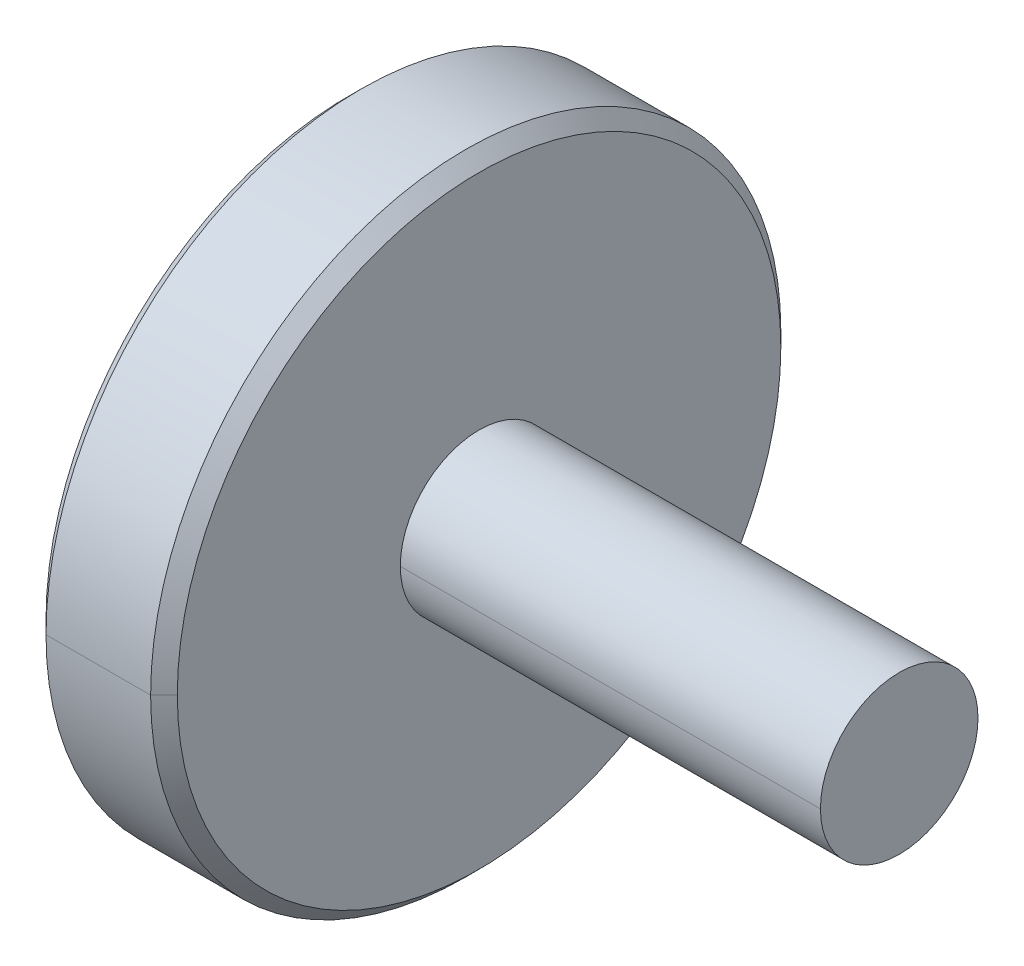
ISO-10303-21;
HEADER;
FILE_DESCRIPTION(('STEP AP214'),'2;1');
FILE_NAME('part.step','',(''),(''),'','','');
FILE_SCHEMA(('AUTOMOTIVE_DESIGN { 1 0 10303 214 1 1 1 1 }'));
ENDSEC;
DATA;
#1=APPLICATION_CONTEXT('core data for automotive mechanical design processes');
#2=APPLICATION_PROTOCOL_DEFINITION('international standard','automotive_design',2000,#1);
#3=PRODUCT_CONTEXT('',#1,'mechanical');
#4=PRODUCT('Part','Part','',(#3));
#5=PRODUCT_RELATED_PRODUCT_CATEGORY('part','',(#4));
#6=PRODUCT_DEFINITION_FORMATION('','',#4);
#7=PRODUCT_DEFINITION_CONTEXT('part definition',#1,'design');
#8=PRODUCT_DEFINITION('design','',#6,#7);
#9=PRODUCT_DEFINITION_SHAPE('','',#8);
#10=(LENGTH_UNIT() NAMED_UNIT(*) SI_UNIT(.MILLI.,.METRE.));
#11=(NAMED_UNIT(*) PLANE_ANGLE_UNIT() SI_UNIT($,.RADIAN.));
#12=(NAMED_UNIT(*) SI_UNIT($,.STERADIAN.) SOLID_ANGLE_UNIT());
#13=UNCERTAINTY_MEASURE_WITH_UNIT(LENGTH_MEASURE(1.E-05),#10,'distance_accuracy_value','');
#14=(GEOMETRIC_REPRESENTATION_CONTEXT(3) GLOBAL_UNCERTAINTY_ASSIGNED_CONTEXT((#13)) GLOBAL_UNIT_ASSIGNED_CONTEXT((#10,
#11,#12)) REPRESENTATION_CONTEXT('',''));
#15=CARTESIAN_POINT('',(0.,0.,0.));
#16=DIRECTION('',(0.,0.,1.));
#17=DIRECTION('',(1.,0.,0.));
#18=AXIS2_PLACEMENT_3D('',#15,#16,#17);
#19=CARTESIAN_POINT('',(0.,0.,0.));
#20=DIRECTION('',(-1.,0.,0.));
#21=DIRECTION('',(0.,0.,1.));
#22=AXIS2_PLACEMENT_3D('',#19,#20,#21);
#23=CYLINDRICAL_SURFACE('',#22,1.5);
#24=CARTESIAN_POINT('',(10.5,0.,0.));
#25=DIRECTION('',(1.,0.,0.));
#26=DIRECTION('',(0.,0.,1.));
#27=AXIS2_PLACEMENT_3D('',#24,#25,#26);
#28=CIRCLE('',#27,1.5);
#29=CARTESIAN_POINT('',(10.5,0.,1.5));
#30=VERTEX_POINT('',#29);
#31=CARTESIAN_POINT('',(10.5,0.,-1.5));
#32=VERTEX_POINT('',#31);
#33=EDGE_CURVE('E11',#30,#32,#28,.T.);
#34=ORIENTED_EDGE('',*,*,#33,.F.);
#35=DIRECTION('',(1.,0.,0.));
#36=VECTOR('',#35,1.);
#37=CARTESIAN_POINT('',(2.5,0.,1.5));
#38=LINE('',#37,#36);
#39=CARTESIAN_POINT('',(2.5,0.,1.5));
#40=VERTEX_POINT('',#39);
#41=EDGE_CURVE('E130',#40,#30,#38,.T.);
#42=ORIENTED_EDGE('',*,*,#41,.F.);
#43=CARTESIAN_POINT('',(2.5,0.,0.));
#44=DIRECTION('',(1.,0.,0.));
#45=DIRECTION('',(0.,0.,1.));
#46=AXIS2_PLACEMENT_3D('',#43,#44,#45);
#47=CIRCLE('',#46,1.5);
#48=CARTESIAN_POINT('',(2.5,0.,-1.5));
#49=VERTEX_POINT('',#48);
#50=EDGE_CURVE('E97',#40,#49,#47,.T.);
#51=ORIENTED_EDGE('',*,*,#50,.T.);
#52=DIRECTION('',(1.,0.,0.));
#53=VECTOR('',#52,1.);
#54=CARTESIAN_POINT('',(2.5,0.,-1.5));
#55=LINE('',#54,#53);
#56=EDGE_CURVE('E25',#49,#32,#55,.T.);
#57=ORIENTED_EDGE('',*,*,#56,.T.);
#58=EDGE_LOOP('',(#34,#42,#51,#57));
#59=FACE_BOUND('',#58,.T.);
#60=ADVANCED_FACE('F17',(#59),#23,.T.);
#61=CARTESIAN_POINT('',(10.5,0.,0.));
#62=DIRECTION('',(-1.,0.,0.));
#63=DIRECTION('',(0.,0.,1.));
#64=AXIS2_PLACEMENT_3D('',#61,#62,#63);
#65=PLANE('',#64);
#66=ORIENTED_EDGE('',*,*,#33,.T.);
#67=CARTESIAN_POINT('',(10.5,0.,0.));
#68=DIRECTION('',(1.,0.,0.));
#69=DIRECTION('',(0.,0.,-1.));
#70=AXIS2_PLACEMENT_3D('',#67,#68,#69);
#71=CIRCLE('',#70,1.5);
#72=EDGE_CURVE('E121',#32,#30,#71,.T.);
#73=ORIENTED_EDGE('',*,*,#72,.T.);
#74=EDGE_LOOP('',(#66,#73));
#75=FACE_BOUND('',#74,.T.);
#76=ADVANCED_FACE('F143',(#75),#65,.F.);
#77=CARTESIAN_POINT('',(0.,0.,0.));
#78=DIRECTION('',(-1.,0.,0.));
#79=DIRECTION('',(0.,0.,1.));
#80=AXIS2_PLACEMENT_3D('',#77,#78,#79);
#81=CYLINDRICAL_SURFACE('',#80,1.5);
#82=ORIENTED_EDGE('',*,*,#56,.F.);
#83=CARTESIAN_POINT('',(2.5,0.,0.));
#84=DIRECTION('',(1.,0.,0.));
#85=DIRECTION('',(0.,0.,-1.));
#86=AXIS2_PLACEMENT_3D('',#83,#84,#85);
#87=CIRCLE('',#86,1.5);
#88=EDGE_CURVE('E81',#49,#40,#87,.T.);
#89=ORIENTED_EDGE('',*,*,#88,.T.);
#90=ORIENTED_EDGE('',*,*,#41,.T.);
#91=ORIENTED_EDGE('',*,*,#72,.F.);
#92=EDGE_LOOP('',(#82,#89,#90,#91));
#93=FACE_BOUND('',#92,.T.);
#94=ADVANCED_FACE('F138',(#93),#81,.T.);
#95=CARTESIAN_POINT('',(-0.0169333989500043,0.,0.));
#96=DIRECTION('',(1.,0.,0.));
#97=DIRECTION('',(0.,0.,-1.));
#98=AXIS2_PLACEMENT_3D('',#95,#96,#97);
#99=CONICAL_SURFACE('',#98,5.72906660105,0.785398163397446);
#100=CARTESIAN_POINT('',(0.,0.,0.));
#101=DIRECTION('',(1.,0.,0.));
#102=DIRECTION('',(0.,0.,1.));
#103=AXIS2_PLACEMENT_3D('',#100,#101,#102);
#104=CIRCLE('',#103,5.746);
#105=CARTESIAN_POINT('',(0.,0.,5.746));
#106=VERTEX_POINT('',#105);
#107=CARTESIAN_POINT('',(0.,0.,-5.746));
#108=VERTEX_POINT('',#107);
#109=EDGE_CURVE('E118',#106,#108,#104,.T.);
#110=ORIENTED_EDGE('',*,*,#109,.T.);
#111=DIRECTION('',(-0.707106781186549,0.,0.707106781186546));
#112=VECTOR('',#111,1.);
#113=CARTESIAN_POINT('',(0.253999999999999,0.,-6.));
#114=LINE('',#113,#112);
#115=CARTESIAN_POINT('',(0.253999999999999,0.,-6.));
#116=VERTEX_POINT('',#115);
#117=EDGE_CURVE('E37',#116,#108,#114,.T.);
#118=ORIENTED_EDGE('',*,*,#117,.F.);
#119=CARTESIAN_POINT('',(0.253999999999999,0.,0.));
#120=DIRECTION('',(-1.,0.,0.));
#121=DIRECTION('',(0.,0.,-1.));
#122=AXIS2_PLACEMENT_3D('',#119,#120,#121);
#123=CIRCLE('',#122,6.);
#124=CARTESIAN_POINT('',(0.253999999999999,0.,6.));
#125=VERTEX_POINT('',#124);
#126=EDGE_CURVE('E32',#116,#125,#123,.T.);
#127=ORIENTED_EDGE('',*,*,#126,.T.);
#128=DIRECTION('',(-0.707106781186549,0.,-0.707106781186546));
#129=VECTOR('',#128,1.);
#130=CARTESIAN_POINT('',(0.253999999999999,0.,6.));
#131=LINE('',#130,#129);
#132=EDGE_CURVE('E115',#125,#106,#131,.T.);
#133=ORIENTED_EDGE('',*,*,#132,.T.);
#134=EDGE_LOOP('',(#110,#118,#127,#133));
#135=FACE_BOUND('',#134,.T.);
#136=ADVANCED_FACE('F150',(#135),#99,.T.);
#137=CARTESIAN_POINT('',(0.,6.,0.));
#138=DIRECTION('',(1.,0.,0.));
#139=DIRECTION('',(0.,0.,-1.));
#140=AXIS2_PLACEMENT_3D('',#137,#138,#139);
#141=PLANE('',#140);
#142=CARTESIAN_POINT('',(0.,0.,0.));
#143=DIRECTION('',(1.,0.,0.));
#144=DIRECTION('',(0.,0.,-1.));
#145=AXIS2_PLACEMENT_3D('',#142,#143,#144);
#146=CIRCLE('',#145,5.746);
#147=EDGE_CURVE('E111',#108,#106,#146,.T.);
#148=ORIENTED_EDGE('',*,*,#147,.F.);
#149=ORIENTED_EDGE('',*,*,#109,.F.);
#150=EDGE_LOOP('',(#148,#149));
#151=FACE_BOUND('',#150,.T.);
#152=ADVANCED_FACE('F155',(#151),#141,.F.);
#153=CARTESIAN_POINT('',(-0.0169333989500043,0.,0.));
#154=DIRECTION('',(1.,0.,0.));
#155=DIRECTION('',(0.,0.,-1.));
#156=AXIS2_PLACEMENT_3D('',#153,#154,#155);
#157=CONICAL_SURFACE('',#156,5.72906660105,0.785398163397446);
#158=ORIENTED_EDGE('',*,*,#132,.F.);
#159=CARTESIAN_POINT('',(0.253999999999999,0.,0.));
#160=DIRECTION('',(-1.,0.,0.));
#161=DIRECTION('',(0.,0.,1.));
#162=AXIS2_PLACEMENT_3D('',#159,#160,#161);
#163=CIRCLE('',#162,6.);
#164=EDGE_CURVE('E105',#125,#116,#163,.T.);
#165=ORIENTED_EDGE('',*,*,#164,.T.);
#166=ORIENTED_EDGE('',*,*,#117,.T.);
#167=ORIENTED_EDGE('',*,*,#147,.T.);
#168=EDGE_LOOP('',(#158,#165,#166,#167));
#169=FACE_BOUND('',#168,.T.);
#170=ADVANCED_FACE('F158',(#169),#157,.T.);
#171=CARTESIAN_POINT('',(0.,0.,0.));
#172=DIRECTION('',(-1.,0.,0.));
#173=DIRECTION('',(0.,0.,1.));
#174=AXIS2_PLACEMENT_3D('',#171,#172,#173);
#175=CYLINDRICAL_SURFACE('',#174,6.);
#176=DIRECTION('',(1.,0.,0.));
#177=VECTOR('',#176,1.);
#178=CARTESIAN_POINT('',(0.253999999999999,0.,-6.));
#179=LINE('',#178,#177);
#180=CARTESIAN_POINT('',(2.246,0.,-6.));
#181=VERTEX_POINT('',#180);
#182=EDGE_CURVE('E102',#116,#181,#179,.T.);
#183=ORIENTED_EDGE('',*,*,#182,.F.);
#184=ORIENTED_EDGE('',*,*,#164,.F.);
#185=DIRECTION('',(1.,0.,0.));
#186=VECTOR('',#185,1.);
#187=CARTESIAN_POINT('',(0.253999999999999,0.,6.));
#188=LINE('',#187,#186);
#189=CARTESIAN_POINT('',(2.246,0.,6.));
#190=VERTEX_POINT('',#189);
#191=EDGE_CURVE('E101',#125,#190,#188,.T.);
#192=ORIENTED_EDGE('',*,*,#191,.T.);
#193=CARTESIAN_POINT('',(2.246,0.,0.));
#194=DIRECTION('',(1.,0.,0.));
#195=DIRECTION('',(0.,0.,-1.));
#196=AXIS2_PLACEMENT_3D('',#193,#194,#195);
#197=CIRCLE('',#196,6.);
#198=EDGE_CURVE('E89',#181,#190,#197,.T.);
#199=ORIENTED_EDGE('',*,*,#198,.F.);
#200=EDGE_LOOP('',(#183,#184,#192,#199));
#201=FACE_BOUND('',#200,.T.);
#202=ADVANCED_FACE('F162',(#201),#175,.T.);
#203=CARTESIAN_POINT('',(0.,0.,0.));
#204=DIRECTION('',(-1.,0.,0.));
#205=DIRECTION('',(0.,0.,1.));
#206=AXIS2_PLACEMENT_3D('',#203,#204,#205);
#207=CYLINDRICAL_SURFACE('',#206,6.);
#208=CARTESIAN_POINT('',(2.246,0.,0.));
#209=DIRECTION('',(1.,0.,0.));
#210=DIRECTION('',(0.,0.,1.));
#211=AXIS2_PLACEMENT_3D('',#208,#209,#210);
#212=CIRCLE('',#211,6.);
#213=EDGE_CURVE('E106',#190,#181,#212,.T.);
#214=ORIENTED_EDGE('',*,*,#213,.F.);
#215=ORIENTED_EDGE('',*,*,#191,.F.);
#216=ORIENTED_EDGE('',*,*,#126,.F.);
#217=ORIENTED_EDGE('',*,*,#182,.T.);
#218=EDGE_LOOP('',(#214,#215,#216,#217));
#219=FACE_BOUND('',#218,.T.);
#220=ADVANCED_FACE('F166',(#219),#207,.T.);
#221=CARTESIAN_POINT('',(2.51693339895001,0.,0.));
#222=DIRECTION('',(-1.,0.,0.));
#223=DIRECTION('',(0.,0.,1.));
#224=AXIS2_PLACEMENT_3D('',#221,#222,#223);
#225=CONICAL_SURFACE('',#224,5.72906660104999,0.785398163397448);
#226=CARTESIAN_POINT('',(2.5,0.,0.));
#227=DIRECTION('',(-1.,0.,0.));
#228=DIRECTION('',(0.,0.,-1.));
#229=AXIS2_PLACEMENT_3D('',#226,#227,#228);
#230=CIRCLE('',#229,5.746);
#231=CARTESIAN_POINT('',(2.5,0.,-5.746));
#232=VERTEX_POINT('',#231);
#233=CARTESIAN_POINT('',(2.5,0.,5.746));
#234=VERTEX_POINT('',#233);
#235=EDGE_CURVE('E69',#232,#234,#230,.T.);
#236=ORIENTED_EDGE('',*,*,#235,.T.);
#237=DIRECTION('',(0.707106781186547,0.,-0.707106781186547));
#238=VECTOR('',#237,1.);
#239=CARTESIAN_POINT('',(2.246,0.,6.));
#240=LINE('',#239,#238);
#241=EDGE_CURVE('E74',#190,#234,#240,.T.);
#242=ORIENTED_EDGE('',*,*,#241,.F.);
#243=ORIENTED_EDGE('',*,*,#213,.T.);
#244=DIRECTION('',(0.707106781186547,0.,0.707106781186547));
#245=VECTOR('',#244,1.);
#246=CARTESIAN_POINT('',(2.246,0.,-6.));
#247=LINE('',#246,#245);
#248=EDGE_CURVE('E77',#181,#232,#247,.T.);
#249=ORIENTED_EDGE('',*,*,#248,.T.);
#250=EDGE_LOOP('',(#236,#242,#243,#249));
#251=FACE_BOUND('',#250,.T.);
#252=ADVANCED_FACE('F71',(#251),#225,.T.);
#253=CARTESIAN_POINT('',(2.5,1.5,0.));
#254=DIRECTION('',(-1.,0.,0.));
#255=DIRECTION('',(0.,0.,1.));
#256=AXIS2_PLACEMENT_3D('',#253,#254,#255);
#257=PLANE('',#256);
#258=ORIENTED_EDGE('',*,*,#50,.F.);
#259=ORIENTED_EDGE('',*,*,#88,.F.);
#260=EDGE_LOOP('',(#258,#259));
#261=FACE_BOUND('',#260,.T.);
#262=CARTESIAN_POINT('',(2.5,0.,0.));
#263=DIRECTION('',(-1.,0.,0.));
#264=DIRECTION('',(0.,0.,1.));
#265=AXIS2_PLACEMENT_3D('',#262,#263,#264);
#266=CIRCLE('',#265,5.746);
#267=EDGE_CURVE('E83',#234,#232,#266,.T.);
#268=ORIENTED_EDGE('',*,*,#267,.F.);
#269=ORIENTED_EDGE('',*,*,#235,.F.);
#270=EDGE_LOOP('',(#268,#269));
#271=FACE_BOUND('',#270,.T.);
#272=ADVANCED_FACE('F84',(#261,#271),#257,.F.);
#273=CARTESIAN_POINT('',(2.51693339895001,0.,0.));
#274=DIRECTION('',(-1.,0.,0.));
#275=DIRECTION('',(0.,0.,1.));
#276=AXIS2_PLACEMENT_3D('',#273,#274,#275);
#277=CONICAL_SURFACE('',#276,5.72906660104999,0.785398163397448);
#278=ORIENTED_EDGE('',*,*,#248,.F.);
#279=ORIENTED_EDGE('',*,*,#198,.T.);
#280=ORIENTED_EDGE('',*,*,#241,.T.);
#281=ORIENTED_EDGE('',*,*,#267,.T.);
#282=EDGE_LOOP('',(#278,#279,#280,#281));
#283=FACE_BOUND('',#282,.T.);
#284=ADVANCED_FACE('F88',(#283),#277,.T.);
#285=CLOSED_SHELL('',(#60,#76,#94,#136,#152,#170,#202,#220,#252,#272,#284));
#286=MANIFOLD_SOLID_BREP('B1',#285);
#287=ADVANCED_BREP_SHAPE_REPRESENTATION('',(#18,#286),#14);
#288=SHAPE_DEFINITION_REPRESENTATION(#9,#287);
ENDSEC;
END-ISO-10303-21;
